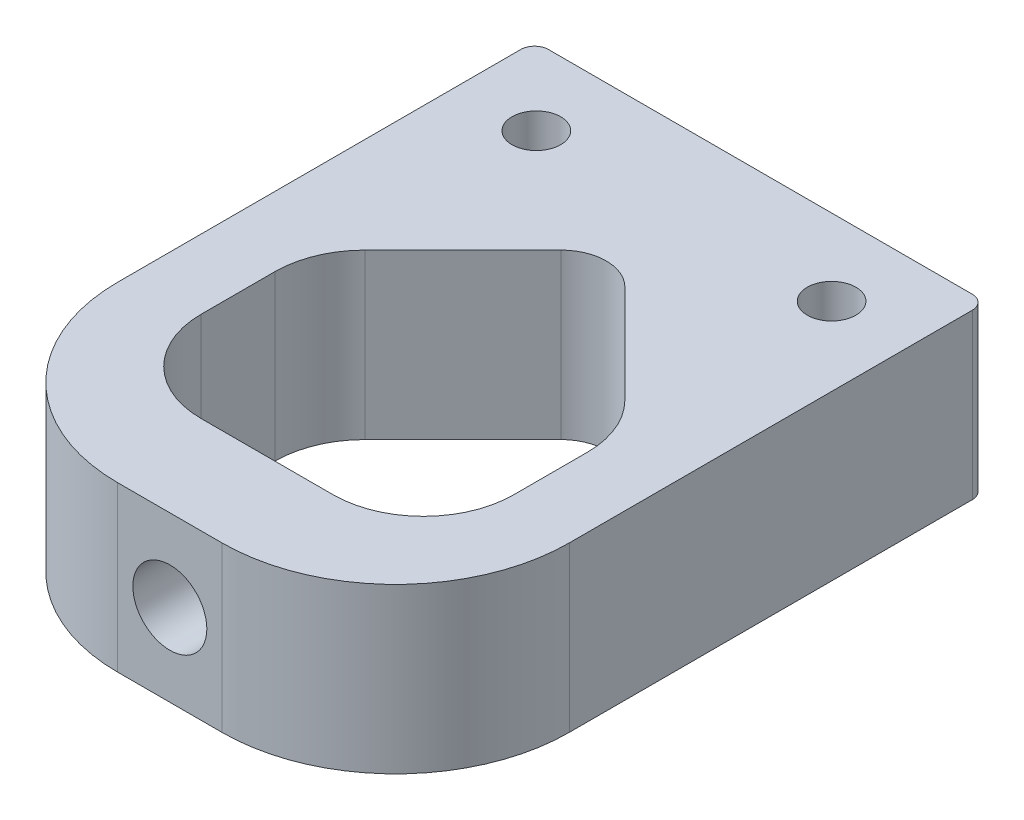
from build123d import *

# Parameters (mm, degrees)
SKETCH1_W                 = 16.51
SKETCH1_H                 = 21.59
BOSS_EXTRUDE1_DEPTH       = 6
F_2_56_TAPPED_HOLE1_D     = 1.778
CUT_EXTRUDE3_DEPTH        = 36.983628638
FILLET3_R                 = 0.508
FILLET1_R                 = 6.35
FILLET4_R                 = 3.302
FILLET5_R                 = 1.651
F_6_32_TAPPED_HOLE1_D     = 2.7051
F_6_32_TAPPED_HOLE1_DEPTH = 3.556


with BuildPart() as part:
    # Sketch1 → Boss-Extrude1 (new body)
    with BuildSketch(Plane(origin=(0, 0, 0), x_dir=(1, 0, 0), z_dir=(0, 1, 0))):
        with Locations((-18.749568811, 12.217492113)):
            Rectangle(SKETCH1_W, SKETCH1_H)
    extrude(amount=BOSS_EXTRUDE1_DEPTH)

    # 2-56 Tapped Hole1 (through all)
    with Locations(Plane(origin=(0, 6, 0), x_dir=(1, 0, 0), z_dir=(0, 1, 0))):
        with Locations((-24.147068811, 20.218492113), (-13.352068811, 20.218492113)):
            Hole(F_2_56_TAPPED_HOLE1_D / 2)

    # Sketch5 → Cut-Extrude3 (cut, through all)
    with BuildSketch(Plane(origin=(0, 6, 0), x_dir=(1, 0, 0), z_dir=(0, 1, 0))):
        Polygon((-18.749568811, 18.059492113), (-13.034568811, 12.344492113), (-13.034568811, 4.978492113), (-24.464568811, 4.978492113), (-24.464568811, 12.344492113), align=None)
    extrude(amount=-CUT_EXTRUDE3_DEPTH, mode=Mode.SUBTRACT)

    # Fillet3
    fillet3_edges = [part.edges().sort_by_distance(p)[0] for p in [
        (-27.004568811, 3, -23.012492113),
        (-10.494568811, 3, -23.012492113),
    ]]
    fillet(fillet3_edges, radius=FILLET3_R)

    # Fillet1
    fillet1_edges = [part.edges().sort_by_distance(p)[0] for p in [
        (-10.494568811, 3, -1.422492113),
        (-27.004568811, 3, -1.422492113),
    ]]
    fillet(fillet1_edges, radius=FILLET1_R)

    # Fillet4
    fillet4_edges = [part.edges().sort_by_distance(p)[0] for p in [
        (-24.464568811, 3, -12.344492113),
        (-13.034568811, 3, -12.344492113),
        (-13.034568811, 3, -4.978492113),
        (-24.464568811, 3, -4.978492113),
    ]]
    fillet(fillet4_edges, radius=FILLET4_R)

    # Fillet5
    fillet5_edges = [part.edges().sort_by_distance(p)[0] for p in [
        (-18.749568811, 3, -18.059492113),
    ]]
    fillet(fillet5_edges, radius=FILLET5_R)

    # 6-32 Tapped Hole1
    with Locations(Plane.XY.offset(-1.422492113)):
        with Locations((-18.749568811, 3)):
            Hole(F_6_32_TAPPED_HOLE1_D / 2, depth=F_6_32_TAPPED_HOLE1_DEPTH)


solid = part.part
